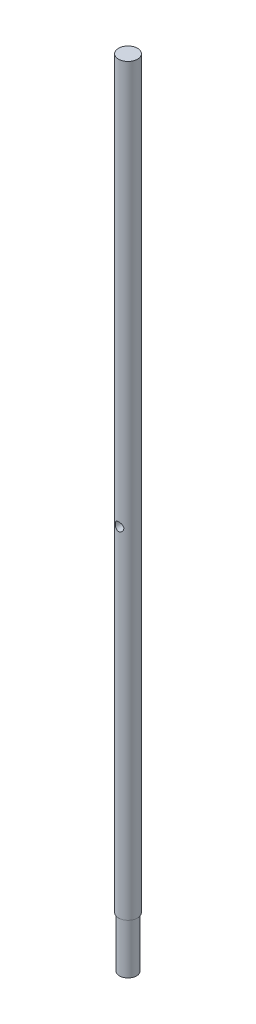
from build123d import *

# Parameters (mm, degrees)
SKETCH1_R               = 4.7625
EXTRUDE1_DEPTH          = 398.78
CUT_EXTRUDE1_DEPTH      = 399.836872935
CUT_EXTRUDE1_DEPTH_BACK = 399.836872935
SKETCH2_R               = 2.15265
SKETCH3_R               = 4.7625
SKETCH3_R_2             = 4.311953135
CUT_EXTRUDE2_DEPTH      = 25.4


with BuildPart() as part:
    # Sketch1 → Extrude1 (new body)
    with BuildSketch(Plane(origin=(0, 0, 0), x_dir=(1, 0, 0), z_dir=(0, 1, 0))):
        with Locations(Location((0, 0, 0), (0, 0, 270))):
            Circle(SKETCH1_R)
    extrude(amount=EXTRUDE1_DEPTH)

    # Sketch2 → Cut-Extrude1 (cut, two sides: drawn at the far end of the back side and taken through both)
    with BuildSketch(Plane.XY.offset(-CUT_EXTRUDE1_DEPTH_BACK)):
        with Locations(Location((0, 195.58, 0), (0, 0, 89.999999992))):
            Circle(SKETCH2_R)
    extrude(amount=CUT_EXTRUDE1_DEPTH + CUT_EXTRUDE1_DEPTH_BACK, mode=Mode.SUBTRACT)

    # Sketch3 → Cut-Extrude2 (cut)
    with BuildSketch(Plane.XZ):
        with Locations(Location((0, 0, 0), (0, 0, 270))):
            Circle(SKETCH3_R)
        with Locations(Location((0, 0, 0), (0, 0, 270))):
            Circle(SKETCH3_R_2, mode=Mode.SUBTRACT)
    extrude(amount=-CUT_EXTRUDE2_DEPTH, mode=Mode.SUBTRACT)


solid = part.part
